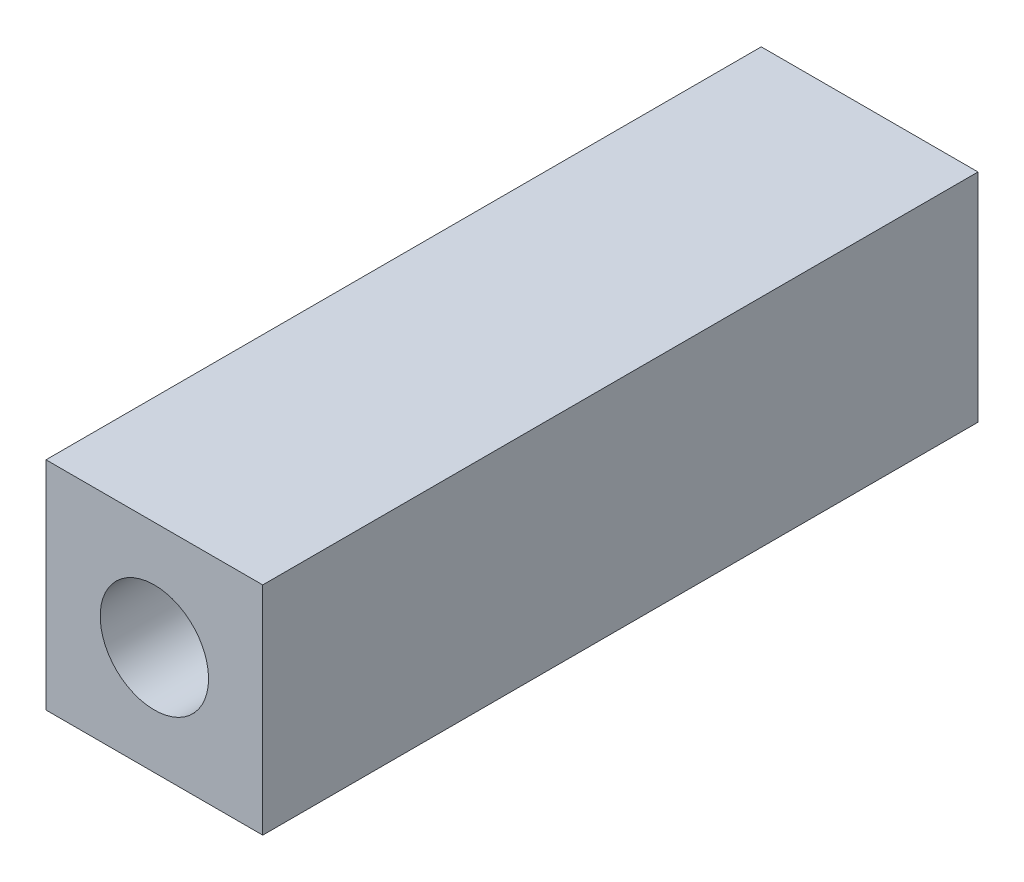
from build123d import *

# Parameters (mm, degrees)
SKETCH1_W           = 12.7
SKETCH1_H           = 12.7
SKETCH1_R           = 3.175
BOSS_EXTRUDE1_DEPTH = 41.91


with BuildPart() as part:
    # Sketch1 → Boss-Extrude1 (new body)
    with BuildSketch(Plane.XY):
        Rectangle(SKETCH1_W, SKETCH1_H)
        Circle(SKETCH1_R, mode=Mode.SUBTRACT)
    extrude(amount=BOSS_EXTRUDE1_DEPTH)


solid = part.part
